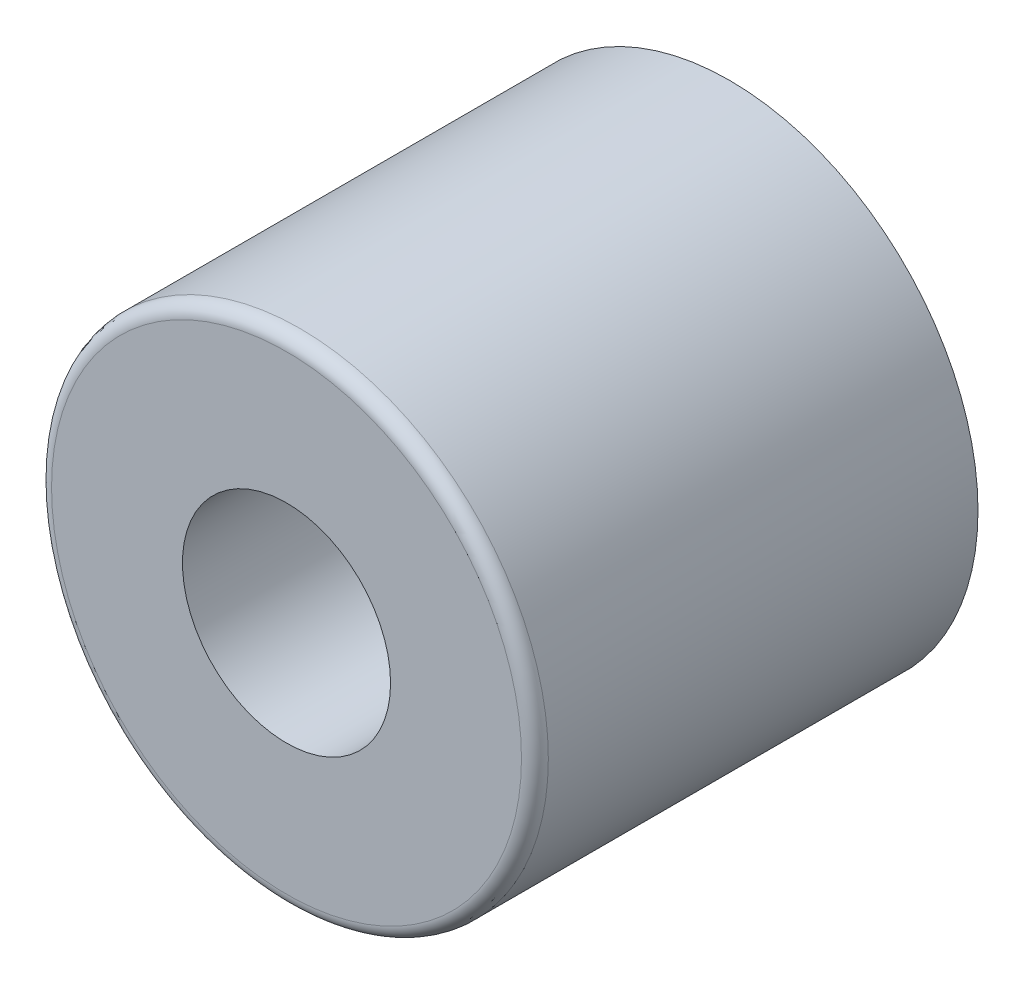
ISO-10303-21;
HEADER;
FILE_DESCRIPTION(('STEP AP214'),'2;1');
FILE_NAME('part.step','',(''),(''),'','','');
FILE_SCHEMA(('AUTOMOTIVE_DESIGN { 1 0 10303 214 1 1 1 1 }'));
ENDSEC;
DATA;
#1=APPLICATION_CONTEXT('core data for automotive mechanical design processes');
#2=APPLICATION_PROTOCOL_DEFINITION('international standard','automotive_design',2000,#1);
#3=PRODUCT_CONTEXT('',#1,'mechanical');
#4=PRODUCT('Part','Part','',(#3));
#5=PRODUCT_RELATED_PRODUCT_CATEGORY('part','',(#4));
#6=PRODUCT_DEFINITION_FORMATION('','',#4);
#7=PRODUCT_DEFINITION_CONTEXT('part definition',#1,'design');
#8=PRODUCT_DEFINITION('design','',#6,#7);
#9=PRODUCT_DEFINITION_SHAPE('','',#8);
#10=(LENGTH_UNIT() NAMED_UNIT(*) SI_UNIT(.MILLI.,.METRE.));
#11=(NAMED_UNIT(*) PLANE_ANGLE_UNIT() SI_UNIT($,.RADIAN.));
#12=(NAMED_UNIT(*) SI_UNIT($,.STERADIAN.) SOLID_ANGLE_UNIT());
#13=UNCERTAINTY_MEASURE_WITH_UNIT(LENGTH_MEASURE(1.E-05),#10,'distance_accuracy_value','');
#14=(GEOMETRIC_REPRESENTATION_CONTEXT(3) GLOBAL_UNCERTAINTY_ASSIGNED_CONTEXT((#13)) GLOBAL_UNIT_ASSIGNED_CONTEXT((#10,
#11,#12)) REPRESENTATION_CONTEXT('',''));
#15=CARTESIAN_POINT('',(0.,0.,0.));
#16=DIRECTION('',(0.,0.,1.));
#17=DIRECTION('',(1.,0.,0.));
#18=AXIS2_PLACEMENT_3D('',#15,#16,#17);
#19=CARTESIAN_POINT('',(0.,0.,33.));
#20=DIRECTION('',(0.,0.,1.));
#21=DIRECTION('',(0.999999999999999,0.,0.));
#22=AXIS2_PLACEMENT_3D('',#19,#20,#21);
#23=PLANE('',#22);
#24=CARTESIAN_POINT('',(0.,0.,33.));
#25=DIRECTION('',(0.,0.,1.));
#26=DIRECTION('',(0.999999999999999,0.,0.));
#27=AXIS2_PLACEMENT_3D('',#24,#25,#26);
#28=CIRCLE('',#27,17.5);
#29=CARTESIAN_POINT('',(17.5,0.,33.));
#30=VERTEX_POINT('',#29);
#31=EDGE_CURVE('E34',#30,#30,#28,.T.);
#32=ORIENTED_EDGE('',*,*,#31,.T.);
#33=EDGE_LOOP('',(#32));
#34=FACE_BOUND('',#33,.T.);
#35=CARTESIAN_POINT('',(0.,0.,33.));
#36=DIRECTION('',(0.,0.,1.));
#37=DIRECTION('',(0.999999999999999,0.,0.));
#38=AXIS2_PLACEMENT_3D('',#35,#36,#37);
#39=CIRCLE('',#38,7.75);
#40=CARTESIAN_POINT('',(7.74999999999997,0.,33.));
#41=VERTEX_POINT('',#40);
#42=EDGE_CURVE('E42',#41,#41,#39,.T.);
#43=ORIENTED_EDGE('',*,*,#42,.F.);
#44=EDGE_LOOP('',(#43));
#45=FACE_BOUND('',#44,.T.);
#46=ADVANCED_FACE('F27',(#34,#45),#23,.T.);
#47=CARTESIAN_POINT('',(0.,0.,0.));
#48=DIRECTION('',(0.,0.,1.));
#49=DIRECTION('',(0.999999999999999,0.,0.));
#50=AXIS2_PLACEMENT_3D('',#47,#48,#49);
#51=PLANE('',#50);
#52=CARTESIAN_POINT('',(0.,0.,0.));
#53=DIRECTION('',(0.,0.,1.));
#54=DIRECTION('',(0.999999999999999,0.,0.));
#55=AXIS2_PLACEMENT_3D('',#52,#53,#54);
#56=CIRCLE('',#55,18.5);
#57=CARTESIAN_POINT('',(18.5,0.,0.));
#58=VERTEX_POINT('',#57);
#59=EDGE_CURVE('E38',#58,#58,#56,.T.);
#60=ORIENTED_EDGE('',*,*,#59,.F.);
#61=EDGE_LOOP('',(#60));
#62=FACE_BOUND('',#61,.T.);
#63=CARTESIAN_POINT('',(0.,0.,0.));
#64=DIRECTION('',(0.,0.,1.));
#65=DIRECTION('',(0.999999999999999,0.,0.));
#66=AXIS2_PLACEMENT_3D('',#63,#64,#65);
#67=CIRCLE('',#66,7.75);
#68=CARTESIAN_POINT('',(7.74999999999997,0.,0.));
#69=VERTEX_POINT('',#68);
#70=EDGE_CURVE('E47',#69,#69,#67,.T.);
#71=ORIENTED_EDGE('',*,*,#70,.T.);
#72=EDGE_LOOP('',(#71));
#73=FACE_BOUND('',#72,.T.);
#74=ADVANCED_FACE('F51',(#62,#73),#51,.F.);
#75=CARTESIAN_POINT('',(0.,0.,33.));
#76=DIRECTION('',(0.,0.,-1.));
#77=DIRECTION('',(-0.999999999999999,0.,0.));
#78=AXIS2_PLACEMENT_3D('',#75,#76,#77);
#79=CYLINDRICAL_SURFACE('',#78,18.5);
#80=CARTESIAN_POINT('',(0.,0.,32.));
#81=DIRECTION('',(0.,0.,1.));
#82=DIRECTION('',(0.999999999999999,0.,0.));
#83=AXIS2_PLACEMENT_3D('',#80,#81,#82);
#84=CIRCLE('',#83,18.5);
#85=CARTESIAN_POINT('',(18.5,0.,32.));
#86=VERTEX_POINT('',#85);
#87=EDGE_CURVE('E10',#86,#86,#84,.F.);
#88=ORIENTED_EDGE('',*,*,#87,.T.);
#89=EDGE_LOOP('',(#88));
#90=FACE_BOUND('',#89,.T.);
#91=ORIENTED_EDGE('',*,*,#59,.T.);
#92=EDGE_LOOP('',(#91));
#93=FACE_BOUND('',#92,.T.);
#94=ADVANCED_FACE('F29',(#90,#93),#79,.T.);
#95=CARTESIAN_POINT('',(0.,0.,33.));
#96=DIRECTION('',(0.,0.,-1.));
#97=DIRECTION('',(-0.999999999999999,0.,0.));
#98=AXIS2_PLACEMENT_3D('',#95,#96,#97);
#99=CYLINDRICAL_SURFACE('',#98,7.75);
#100=ORIENTED_EDGE('',*,*,#42,.T.);
#101=EDGE_LOOP('',(#100));
#102=FACE_BOUND('',#101,.T.);
#103=ORIENTED_EDGE('',*,*,#70,.F.);
#104=EDGE_LOOP('',(#103));
#105=FACE_BOUND('',#104,.T.);
#106=ADVANCED_FACE('F53',(#102,#105),#99,.F.);
#107=CARTESIAN_POINT('',(0.,0.,32.));
#108=DIRECTION('',(0.,0.,1.));
#109=DIRECTION('',(0.999999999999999,0.,0.));
#110=AXIS2_PLACEMENT_3D('',#107,#108,#109);
#111=TOROIDAL_SURFACE('',#110,17.5,1.);
#112=ORIENTED_EDGE('',*,*,#87,.F.);
#113=EDGE_LOOP('',(#112));
#114=FACE_BOUND('',#113,.T.);
#115=ORIENTED_EDGE('',*,*,#31,.F.);
#116=EDGE_LOOP('',(#115));
#117=FACE_BOUND('',#116,.T.);
#118=ADVANCED_FACE('F55',(#114,#117),#111,.T.);
#119=CLOSED_SHELL('',(#46,#74,#94,#106,#118));
#120=MANIFOLD_SOLID_BREP('B2',#119);
#121=ADVANCED_BREP_SHAPE_REPRESENTATION('',(#18,#120),#14);
#122=SHAPE_DEFINITION_REPRESENTATION(#9,#121);
ENDSEC;
END-ISO-10303-21;
